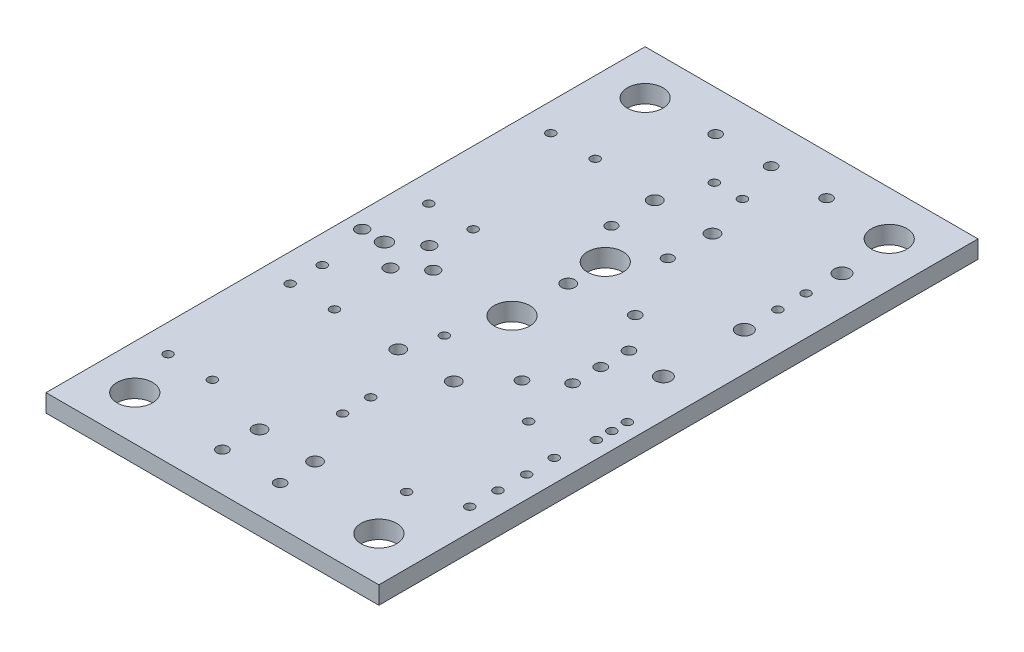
from build123d import *

# Parameters (mm, degrees)
ESQUISSE2_W      = 30
ESQUISSE2_H      = 54
ESQUISSE2_R      = 0.59944
ESQUISSE2_R_2    = 1.6002
ESQUISSE2_R_3    = 0.50038
ESQUISSE2_R_4    = 0.4826
ESQUISSE2_R_5    = 0.39878
ESQUISSE2_R_6    = 0.55118
ESQUISSE2_R_7    = 0.65024
ESQUISSE2_R_8    = 0.70104
EXTRUSION1_DEPTH = 1.6


with BuildPart() as part:
    # Esquisse2 → Extrusion1 (new body)
    with BuildSketch(Plane(origin=(0, 0, 0), x_dir=(1, 0, 0), z_dir=(0, 1, 0))):
        with Locations((15, 27)):
            Rectangle(ESQUISSE2_W, ESQUISSE2_H)
        with Locations(Location((17.62252, 42.44594, 0), (0, 0, 270))):
            Circle(ESQUISSE2_R, mode=Mode.SUBTRACT)
        with Locations(Location((12.4206, 42.44594, 0), (0, 0, 270))):
            Circle(ESQUISSE2_R, mode=Mode.SUBTRACT)
        with Locations(Location((15.02156, 32.04464, 0), (0, 0, 270))):
            Circle(ESQUISSE2_R, mode=Mode.SUBTRACT)
        with Locations(Location((15.00378, 35.40252, 0), (0, 0, 270))):
            Circle(ESQUISSE2_R_2, mode=Mode.SUBTRACT)
        with Locations(Location((17.59966, 3.50012, 0), (0, 0, 270))):
            Circle(ESQUISSE2_R_3, mode=Mode.SUBTRACT)
        with Locations(Location((12.40028, 3.50012, 0), (0, 0, 270))):
            Circle(ESQUISSE2_R_3, mode=Mode.SUBTRACT)
        with Locations(Location((15.00124, 50.35042, 0), (0, 0, 270))):
            Circle(ESQUISSE2_R_3, mode=Mode.SUBTRACT)
        with Locations(Location((19.99996, 50.35042, 0), (0, 0, 270))):
            Circle(ESQUISSE2_R_3, mode=Mode.SUBTRACT)
        with Locations(Location((9.99998, 50.35042, 0), (0, 0, 270))):
            Circle(ESQUISSE2_R_3, mode=Mode.SUBTRACT)
        with Locations(Location((12.49934, 19.25066, 0), (0, 0, 270))):
            Circle(ESQUISSE2_R, mode=Mode.SUBTRACT)
        with Locations(Location((12.49934, 6.74878, 0), (0, 0, 270))):
            Circle(ESQUISSE2_R, mode=Mode.SUBTRACT)
        with Locations(Location((17.5006, 19.25066, 0), (0, 0, 270))):
            Circle(ESQUISSE2_R, mode=Mode.SUBTRACT)
        with Locations(Location((17.5006, 6.74878, 0), (0, 0, 270))):
            Circle(ESQUISSE2_R, mode=Mode.SUBTRACT)
        with Locations(Location((20.50034, 22.40026, 0), (0, 0, 270))):
            Circle(ESQUISSE2_R_3, mode=Mode.SUBTRACT)
        with Locations(Location((20.50034, 32.6009, 0), (0, 0, 270))):
            Circle(ESQUISSE2_R_3, mode=Mode.SUBTRACT)
        with Locations(Location((12.46124, 38.49878, 0), (0, 0, 270))):
            Circle(ESQUISSE2_R_4, mode=Mode.SUBTRACT)
        with Locations(Location((17.54124, 38.49878, 0), (0, 0, 270))):
            Circle(ESQUISSE2_R_4, mode=Mode.SUBTRACT)
        with Locations(Location((16.27124, 46.49978, 0), (0, 0, 270))):
            Circle(ESQUISSE2_R_5, mode=Mode.SUBTRACT)
        with Locations(Location((13.73124, 46.49978, 0), (0, 0, 270))):
            Circle(ESQUISSE2_R_5, mode=Mode.SUBTRACT)
        with Locations(Location((15.00124, 11.72972, 0), (0, 0, 270))):
            Circle(ESQUISSE2_R_5, mode=Mode.SUBTRACT)
        with Locations(Location((15.00124, 14.26972, 0), (0, 0, 270))):
            Circle(ESQUISSE2_R_5, mode=Mode.SUBTRACT)
        with Locations(Location((1.4986, 27.0002, 0), (0, 0, 270))):
            Circle(ESQUISSE2_R_6, mode=Mode.SUBTRACT)
        with Locations(Location((7.8994, 27.0002, 0), (0, 0, 270))):
            Circle(ESQUISSE2_R_6, mode=Mode.SUBTRACT)
        with Locations(Location((5.79882, 25.25014, 0), (0, 0, 270))):
            Circle(ESQUISSE2_R_6, mode=Mode.SUBTRACT)
        with Locations(Location((5.79882, 28.75026, 0), (0, 0, 270))):
            Circle(ESQUISSE2_R_6, mode=Mode.SUBTRACT)
        with Locations(Location((3.50012, 27.0002, 0), (0, 0, 270))):
            Circle(ESQUISSE2_R_7, mode=Mode.SUBTRACT)
        with Locations(Location((4.0005, 49.9999, 0), (0, 0, 270))):
            Circle(ESQUISSE2_R_2, mode=Mode.SUBTRACT)
        with Locations(Location((25.99944, 49.9999, 0), (0, 0, 270))):
            Circle(ESQUISSE2_R_2, mode=Mode.SUBTRACT)
        with Locations(Location((4.0005, 4.0005, 0), (0, 0, 270))):
            Circle(ESQUISSE2_R_2, mode=Mode.SUBTRACT)
        with Locations(Location((15.00124, 27.0002, 0), (0, 0, 270))):
            Circle(ESQUISSE2_R_2, mode=Mode.SUBTRACT)
        with Locations(Location((25.99944, 4.0005, 0), (0, 0, 270))):
            Circle(ESQUISSE2_R_2, mode=Mode.SUBTRACT)
        with Locations(Location((22.9997, 24.4602, 0), (0, 0, 270))):
            Circle(ESQUISSE2_R_3, mode=Mode.SUBTRACT)
        with Locations(Location((22.9997, 27.0002, 0), (0, 0, 270))):
            Circle(ESQUISSE2_R_3, mode=Mode.SUBTRACT)
        with Locations(Location((22.9997, 29.5402, 0), (0, 0, 270))):
            Circle(ESQUISSE2_R_3, mode=Mode.SUBTRACT)
        with Locations(Location((28.04922, 15.27048, 0), (0, 0, 270))):
            Circle(ESQUISSE2_R_5, mode=Mode.SUBTRACT)
        with Locations(Location((28.00096, 12.73048, 0), (0, 0, 270))):
            Circle(ESQUISSE2_R_5, mode=Mode.SUBTRACT)
        with Locations(Location((28.00096, 10.19048, 0), (0, 0, 270))):
            Circle(ESQUISSE2_R_5, mode=Mode.SUBTRACT)
        with Locations(Location((28.00096, 17.81048, 0), (0, 0, 270))):
            Circle(ESQUISSE2_R_5, mode=Mode.SUBTRACT)
        with Locations(Location((26.49982, 41.9989, 0), (0, 0, 270))):
            Circle(ESQUISSE2_R_5, mode=Mode.SUBTRACT)
        with Locations(Location((26.49982, 39.4589, 0), (0, 0, 270))):
            Circle(ESQUISSE2_R_5, mode=Mode.SUBTRACT)
        with Locations(Location((26.56078, 45.17898, 0), (0, 0, 270))):
            Circle(ESQUISSE2_R_8, mode=Mode.SUBTRACT)
        with Locations(Location((26.56078, 36.38042, 0), (0, 0, 270))):
            Circle(ESQUISSE2_R_8, mode=Mode.SUBTRACT)
        with Locations(Location((26.56078, 29.08046, 0), (0, 0, 270))):
            Circle(ESQUISSE2_R_8, mode=Mode.SUBTRACT)
        with Locations(Location((24.00046, 8.49884, 0), (0, 0, 270))):
            Circle(ESQUISSE2_R_5, mode=Mode.SUBTRACT)
        with Locations(Location((24.00046, 19.49958, 0), (0, 0, 270))):
            Circle(ESQUISSE2_R_5, mode=Mode.SUBTRACT)
        with Locations(Location((6.49986, 42.99966, 0), (0, 0, 270))):
            Circle(ESQUISSE2_R_5, mode=Mode.SUBTRACT)
        with Locations(Location((6.49986, 31.99892, 0), (0, 0, 270))):
            Circle(ESQUISSE2_R_5, mode=Mode.SUBTRACT)
        with Locations(Location((2.49936, 42.99966, 0), (0, 0, 270))):
            Circle(ESQUISSE2_R_5, mode=Mode.SUBTRACT)
        with Locations(Location((2.49936, 31.99892, 0), (0, 0, 270))):
            Circle(ESQUISSE2_R_5, mode=Mode.SUBTRACT)
        with Locations(Location((6.49986, 8.49884, 0), (0, 0, 270))):
            Circle(ESQUISSE2_R_5, mode=Mode.SUBTRACT)
        with Locations(Location((6.49986, 19.49958, 0), (0, 0, 270))):
            Circle(ESQUISSE2_R_5, mode=Mode.SUBTRACT)
        with Locations(Location((2.49936, 8.49884, 0), (0, 0, 270))):
            Circle(ESQUISSE2_R_5, mode=Mode.SUBTRACT)
        with Locations(Location((2.49936, 19.49958, 0), (0, 0, 270))):
            Circle(ESQUISSE2_R_5, mode=Mode.SUBTRACT)
        with Locations(Location((2.49936, 22.40026, 0), (0, 0, 270))):
            Circle(ESQUISSE2_R_5, mode=Mode.SUBTRACT)
        with Locations(Location((13.5001, 22.40026, 0), (0, 0, 270))):
            Circle(ESQUISSE2_R_5, mode=Mode.SUBTRACT)
        with Locations(Location((28.4988, 21.09978, 0), (0, 0, 270))):
            Circle(ESQUISSE2_R_5, mode=Mode.SUBTRACT)
        with Locations(Location((28.4988, 22.49932, 0), (0, 0, 270))):
            Circle(ESQUISSE2_R_5, mode=Mode.SUBTRACT)
        with Locations(Location((28.4988, 23.89886, 0), (0, 0, 270))):
            Circle(ESQUISSE2_R_5, mode=Mode.SUBTRACT)
    extrude(amount=EXTRUSION1_DEPTH)


solid = part.part
